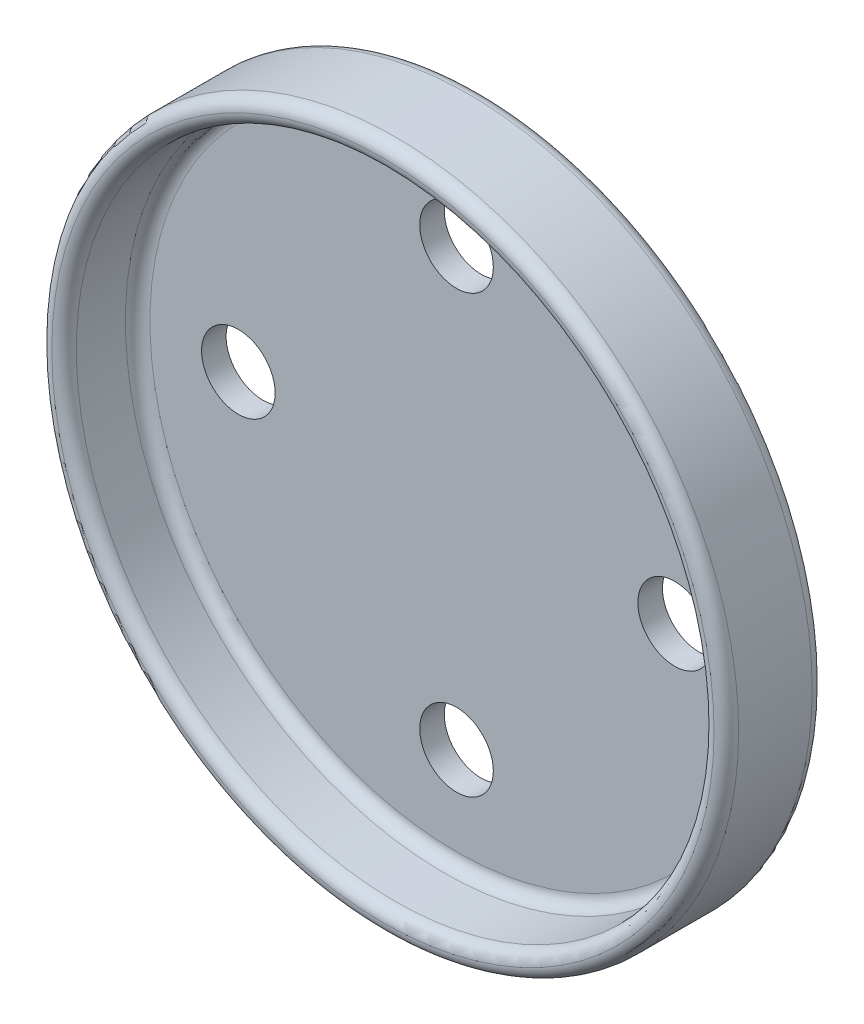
ISO-10303-21;
HEADER;
FILE_DESCRIPTION(('STEP AP214'),'2;1');
FILE_NAME('part.step','',(''),(''),'','','');
FILE_SCHEMA(('AUTOMOTIVE_DESIGN { 1 0 10303 214 1 1 1 1 }'));
ENDSEC;
DATA;
#1=APPLICATION_CONTEXT('core data for automotive mechanical design processes');
#2=APPLICATION_PROTOCOL_DEFINITION('international standard','automotive_design',2000,#1);
#3=PRODUCT_CONTEXT('',#1,'mechanical');
#4=PRODUCT('Part','Part','',(#3));
#5=PRODUCT_RELATED_PRODUCT_CATEGORY('part','',(#4));
#6=PRODUCT_DEFINITION_FORMATION('','',#4);
#7=PRODUCT_DEFINITION_CONTEXT('part definition',#1,'design');
#8=PRODUCT_DEFINITION('design','',#6,#7);
#9=PRODUCT_DEFINITION_SHAPE('','',#8);
#10=(LENGTH_UNIT() NAMED_UNIT(*) SI_UNIT(.MILLI.,.METRE.));
#11=(NAMED_UNIT(*) PLANE_ANGLE_UNIT() SI_UNIT($,.RADIAN.));
#12=(NAMED_UNIT(*) SI_UNIT($,.STERADIAN.) SOLID_ANGLE_UNIT());
#13=UNCERTAINTY_MEASURE_WITH_UNIT(LENGTH_MEASURE(1.E-05),#10,'distance_accuracy_value','');
#14=(GEOMETRIC_REPRESENTATION_CONTEXT(3) GLOBAL_UNCERTAINTY_ASSIGNED_CONTEXT((#13)) GLOBAL_UNIT_ASSIGNED_CONTEXT((#10,
#11,#12)) REPRESENTATION_CONTEXT('',''));
#15=CARTESIAN_POINT('',(0.,0.,0.));
#16=DIRECTION('',(0.,0.,1.));
#17=DIRECTION('',(1.,0.,0.));
#18=AXIS2_PLACEMENT_3D('',#15,#16,#17);
#19=CARTESIAN_POINT('',(0.,0.,20.));
#20=DIRECTION('',(0.,0.,-1.));
#21=DIRECTION('',(-1.,0.,0.));
#22=AXIS2_PLACEMENT_3D('',#19,#20,#21);
#23=CYLINDRICAL_SURFACE('',#22,70.);
#24=CARTESIAN_POINT('',(0.,0.,2.5));
#25=DIRECTION('',(0.,0.,1.));
#26=DIRECTION('',(1.,0.,0.));
#27=AXIS2_PLACEMENT_3D('',#24,#25,#26);
#28=CIRCLE('',#27,70.);
#29=CARTESIAN_POINT('',(70.,0.,2.5));
#30=VERTEX_POINT('',#29);
#31=EDGE_CURVE('E53',#30,#30,#28,.T.);
#32=ORIENTED_EDGE('',*,*,#31,.T.);
#33=EDGE_LOOP('',(#32));
#34=FACE_BOUND('',#33,.T.);
#35=CARTESIAN_POINT('',(0.,0.,17.5));
#36=DIRECTION('',(0.,0.,1.));
#37=DIRECTION('',(1.,0.,0.));
#38=AXIS2_PLACEMENT_3D('',#35,#36,#37);
#39=CIRCLE('',#38,70.);
#40=CARTESIAN_POINT('',(70.,0.,17.5));
#41=VERTEX_POINT('',#40);
#42=EDGE_CURVE('E56',#41,#41,#39,.F.);
#43=ORIENTED_EDGE('',*,*,#42,.T.);
#44=EDGE_LOOP('',(#43));
#45=FACE_BOUND('',#44,.T.);
#46=ADVANCED_FACE('F33',(#34,#45),#23,.T.);
#47=CARTESIAN_POINT('',(0.,0.,0.));
#48=DIRECTION('',(0.,0.,1.));
#49=DIRECTION('',(1.,0.,0.));
#50=AXIS2_PLACEMENT_3D('',#47,#48,#49);
#51=PLANE('',#50);
#52=CARTESIAN_POINT('',(-4.66897023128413E-13,-44.475,0.));
#53=DIRECTION('',(0.,0.,1.));
#54=DIRECTION('',(1.,0.,0.));
#55=AXIS2_PLACEMENT_3D('',#52,#53,#54);
#56=CIRCLE('',#55,7.5);
#57=CARTESIAN_POINT('',(7.49999999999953,-44.475,0.));
#58=VERTEX_POINT('',#57);
#59=EDGE_CURVE('E77',#58,#58,#56,.T.);
#60=ORIENTED_EDGE('',*,*,#59,.T.);
#61=EDGE_LOOP('',(#60));
#62=FACE_BOUND('',#61,.T.);
#63=CARTESIAN_POINT('',(44.475,0.,0.));
#64=DIRECTION('',(0.,0.,1.));
#65=DIRECTION('',(1.,0.,0.));
#66=AXIS2_PLACEMENT_3D('',#63,#64,#65);
#67=CIRCLE('',#66,7.5);
#68=CARTESIAN_POINT('',(51.975,0.,0.));
#69=VERTEX_POINT('',#68);
#70=EDGE_CURVE('E71',#69,#69,#67,.T.);
#71=ORIENTED_EDGE('',*,*,#70,.T.);
#72=EDGE_LOOP('',(#71));
#73=FACE_BOUND('',#72,.T.);
#74=CARTESIAN_POINT('',(1.56329758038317E-13,44.475,0.));
#75=DIRECTION('',(0.,0.,1.));
#76=DIRECTION('',(1.,0.,0.));
#77=AXIS2_PLACEMENT_3D('',#74,#75,#76);
#78=CIRCLE('',#77,7.5);
#79=CARTESIAN_POINT('',(7.50000000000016,44.475,0.));
#80=VERTEX_POINT('',#79);
#81=EDGE_CURVE('E65',#80,#80,#78,.T.);
#82=ORIENTED_EDGE('',*,*,#81,.T.);
#83=EDGE_LOOP('',(#82));
#84=FACE_BOUND('',#83,.T.);
#85=CARTESIAN_POINT('',(-44.475,0.,0.));
#86=DIRECTION('',(0.,0.,1.));
#87=DIRECTION('',(1.,0.,0.));
#88=AXIS2_PLACEMENT_3D('',#85,#86,#87);
#89=CIRCLE('',#88,7.5);
#90=CARTESIAN_POINT('',(-36.975,0.,0.));
#91=VERTEX_POINT('',#90);
#92=EDGE_CURVE('E59',#91,#91,#89,.T.);
#93=ORIENTED_EDGE('',*,*,#92,.T.);
#94=EDGE_LOOP('',(#93));
#95=FACE_BOUND('',#94,.T.);
#96=CARTESIAN_POINT('',(0.,0.,0.));
#97=DIRECTION('',(0.,0.,1.));
#98=DIRECTION('',(1.,0.,0.));
#99=AXIS2_PLACEMENT_3D('',#96,#97,#98);
#100=CIRCLE('',#99,67.5);
#101=CARTESIAN_POINT('',(67.5,0.,0.));
#102=VERTEX_POINT('',#101);
#103=EDGE_CURVE('E50',#102,#102,#100,.F.);
#104=ORIENTED_EDGE('',*,*,#103,.T.);
#105=EDGE_LOOP('',(#104));
#106=FACE_BOUND('',#105,.T.);
#107=ADVANCED_FACE('F114',(#62,#73,#84,#95,#106),#51,.F.);
#108=CARTESIAN_POINT('',(0.,0.,20.));
#109=DIRECTION('',(0.,0.,-1.));
#110=DIRECTION('',(-1.,0.,0.));
#111=AXIS2_PLACEMENT_3D('',#108,#109,#110);
#112=CYLINDRICAL_SURFACE('',#111,65.);
#113=CARTESIAN_POINT('',(0.,0.,7.5));
#114=DIRECTION('',(0.,0.,1.));
#115=DIRECTION('',(1.,0.,0.));
#116=AXIS2_PLACEMENT_3D('',#113,#114,#115);
#117=CIRCLE('',#116,65.);
#118=CARTESIAN_POINT('',(65.,0.,7.5));
#119=VERTEX_POINT('',#118);
#120=EDGE_CURVE('E10',#119,#119,#117,.F.);
#121=ORIENTED_EDGE('',*,*,#120,.T.);
#122=EDGE_LOOP('',(#121));
#123=FACE_BOUND('',#122,.T.);
#124=CARTESIAN_POINT('',(0.,0.,17.5));
#125=DIRECTION('',(0.,0.,1.));
#126=DIRECTION('',(1.,0.,0.));
#127=AXIS2_PLACEMENT_3D('',#124,#125,#126);
#128=CIRCLE('',#127,65.);
#129=CARTESIAN_POINT('',(65.,0.,17.5));
#130=VERTEX_POINT('',#129);
#131=EDGE_CURVE('E41',#130,#130,#128,.T.);
#132=ORIENTED_EDGE('',*,*,#131,.T.);
#133=EDGE_LOOP('',(#132));
#134=FACE_BOUND('',#133,.T.);
#135=ADVANCED_FACE('F91',(#123,#134),#112,.F.);
#136=CARTESIAN_POINT('',(0.,0.,5.));
#137=DIRECTION('',(0.,0.,1.));
#138=DIRECTION('',(1.,0.,0.));
#139=AXIS2_PLACEMENT_3D('',#136,#137,#138);
#140=PLANE('',#139);
#141=CARTESIAN_POINT('',(-4.66897023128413E-13,-44.475,5.));
#142=DIRECTION('',(0.,0.,1.));
#143=DIRECTION('',(0.,1.,0.));
#144=AXIS2_PLACEMENT_3D('',#141,#142,#143);
#145=CIRCLE('',#144,7.5);
#146=CARTESIAN_POINT('',(-3.88338693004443E-13,-36.975,5.));
#147=VERTEX_POINT('',#146);
#148=EDGE_CURVE('E80',#147,#147,#145,.T.);
#149=ORIENTED_EDGE('',*,*,#148,.F.);
#150=EDGE_LOOP('',(#149));
#151=FACE_BOUND('',#150,.T.);
#152=CARTESIAN_POINT('',(44.475,0.,5.));
#153=DIRECTION('',(0.,0.,1.));
#154=DIRECTION('',(-1.,0.,0.));
#155=AXIS2_PLACEMENT_3D('',#152,#153,#154);
#156=CIRCLE('',#155,7.5);
#157=CARTESIAN_POINT('',(36.975,0.,5.));
#158=VERTEX_POINT('',#157);
#159=EDGE_CURVE('E74',#158,#158,#156,.T.);
#160=ORIENTED_EDGE('',*,*,#159,.F.);
#161=EDGE_LOOP('',(#160));
#162=FACE_BOUND('',#161,.T.);
#163=CARTESIAN_POINT('',(1.56329758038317E-13,44.475,5.));
#164=DIRECTION('',(0.,0.,1.));
#165=DIRECTION('',(0.,-1.,0.));
#166=AXIS2_PLACEMENT_3D('',#163,#164,#165);
#167=CIRCLE('',#166,7.5);
#168=CARTESIAN_POINT('',(1.30143647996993E-13,36.975,5.));
#169=VERTEX_POINT('',#168);
#170=EDGE_CURVE('E68',#169,#169,#167,.T.);
#171=ORIENTED_EDGE('',*,*,#170,.F.);
#172=EDGE_LOOP('',(#171));
#173=FACE_BOUND('',#172,.T.);
#174=CARTESIAN_POINT('',(-44.475,0.,5.));
#175=DIRECTION('',(0.,0.,1.));
#176=DIRECTION('',(1.,0.,0.));
#177=AXIS2_PLACEMENT_3D('',#174,#175,#176);
#178=CIRCLE('',#177,7.5);
#179=CARTESIAN_POINT('',(-36.975,0.,5.));
#180=VERTEX_POINT('',#179);
#181=EDGE_CURVE('E62',#180,#180,#178,.T.);
#182=ORIENTED_EDGE('',*,*,#181,.F.);
#183=EDGE_LOOP('',(#182));
#184=FACE_BOUND('',#183,.T.);
#185=CARTESIAN_POINT('',(0.,0.,5.));
#186=DIRECTION('',(0.,0.,1.));
#187=DIRECTION('',(1.,0.,0.));
#188=AXIS2_PLACEMENT_3D('',#185,#186,#187);
#189=CIRCLE('',#188,62.5);
#190=CARTESIAN_POINT('',(62.5,0.,5.));
#191=VERTEX_POINT('',#190);
#192=EDGE_CURVE('E45',#191,#191,#189,.T.);
#193=ORIENTED_EDGE('',*,*,#192,.T.);
#194=EDGE_LOOP('',(#193));
#195=FACE_BOUND('',#194,.T.);
#196=ADVANCED_FACE('F87',(#151,#162,#173,#184,#195),#140,.T.);
#197=CARTESIAN_POINT('',(0.,0.,2.5));
#198=DIRECTION('',(0.,0.,1.));
#199=DIRECTION('',(1.,0.,0.));
#200=AXIS2_PLACEMENT_3D('',#197,#198,#199);
#201=TOROIDAL_SURFACE('',#200,67.5,2.5);
#202=ORIENTED_EDGE('',*,*,#103,.F.);
#203=EDGE_LOOP('',(#202));
#204=FACE_BOUND('',#203,.T.);
#205=ORIENTED_EDGE('',*,*,#31,.F.);
#206=EDGE_LOOP('',(#205));
#207=FACE_BOUND('',#206,.T.);
#208=ADVANCED_FACE('F90',(#204,#207),#201,.T.);
#209=CARTESIAN_POINT('',(0.,0.,7.5));
#210=DIRECTION('',(0.,0.,1.));
#211=DIRECTION('',(1.,0.,0.));
#212=AXIS2_PLACEMENT_3D('',#209,#210,#211);
#213=TOROIDAL_SURFACE('',#212,62.5,2.5);
#214=ORIENTED_EDGE('',*,*,#120,.F.);
#215=EDGE_LOOP('',(#214));
#216=FACE_BOUND('',#215,.T.);
#217=ORIENTED_EDGE('',*,*,#192,.F.);
#218=EDGE_LOOP('',(#217));
#219=FACE_BOUND('',#218,.T.);
#220=ADVANCED_FACE('F101',(#216,#219),#213,.F.);
#221=CARTESIAN_POINT('',(0.,0.,17.5));
#222=DIRECTION('',(0.,0.,1.));
#223=DIRECTION('',(1.,0.,0.));
#224=AXIS2_PLACEMENT_3D('',#221,#222,#223);
#225=TOROIDAL_SURFACE('',#224,67.5,2.5);
#226=ORIENTED_EDGE('',*,*,#42,.F.);
#227=EDGE_LOOP('',(#226));
#228=FACE_BOUND('',#227,.T.);
#229=CARTESIAN_POINT('',(0.,0.,20.));
#230=DIRECTION('',(0.,0.,1.));
#231=DIRECTION('',(1.,0.,0.));
#232=AXIS2_PLACEMENT_3D('',#229,#230,#231);
#233=CIRCLE('',#232,67.5);
#234=CARTESIAN_POINT('',(67.5,0.,20.));
#235=VERTEX_POINT('',#234);
#236=EDGE_CURVE('E37',#235,#235,#233,.T.);
#237=ORIENTED_EDGE('',*,*,#236,.F.);
#238=EDGE_LOOP('',(#237));
#239=FACE_BOUND('',#238,.T.);
#240=ADVANCED_FACE('F35',(#228,#239),#225,.T.);
#241=CARTESIAN_POINT('',(0.,0.,17.5));
#242=DIRECTION('',(0.,0.,1.));
#243=DIRECTION('',(1.,0.,0.));
#244=AXIS2_PLACEMENT_3D('',#241,#242,#243);
#245=TOROIDAL_SURFACE('',#244,67.5,2.5);
#246=ORIENTED_EDGE('',*,*,#236,.T.);
#247=EDGE_LOOP('',(#246));
#248=FACE_BOUND('',#247,.T.);
#249=ORIENTED_EDGE('',*,*,#131,.F.);
#250=EDGE_LOOP('',(#249));
#251=FACE_BOUND('',#250,.T.);
#252=ADVANCED_FACE('F109',(#248,#251),#245,.T.);
#253=CARTESIAN_POINT('',(-44.475,0.,-15.));
#254=DIRECTION('',(0.,0.,1.));
#255=DIRECTION('',(1.,0.,0.));
#256=AXIS2_PLACEMENT_3D('',#253,#254,#255);
#257=CYLINDRICAL_SURFACE('',#256,7.5);
#258=ORIENTED_EDGE('',*,*,#181,.T.);
#259=EDGE_LOOP('',(#258));
#260=FACE_BOUND('',#259,.T.);
#261=ORIENTED_EDGE('',*,*,#92,.F.);
#262=EDGE_LOOP('',(#261));
#263=FACE_BOUND('',#262,.T.);
#264=ADVANCED_FACE('F126',(#260,#263),#257,.F.);
#265=CARTESIAN_POINT('',(1.56329758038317E-13,44.475,-15.));
#266=DIRECTION('',(0.,0.,1.));
#267=DIRECTION('',(1.,0.,0.));
#268=AXIS2_PLACEMENT_3D('',#265,#266,#267);
#269=CYLINDRICAL_SURFACE('',#268,7.5);
#270=ORIENTED_EDGE('',*,*,#170,.T.);
#271=EDGE_LOOP('',(#270));
#272=FACE_BOUND('',#271,.T.);
#273=ORIENTED_EDGE('',*,*,#81,.F.);
#274=EDGE_LOOP('',(#273));
#275=FACE_BOUND('',#274,.T.);
#276=ADVANCED_FACE('F129',(#272,#275),#269,.F.);
#277=CARTESIAN_POINT('',(44.475,0.,-15.));
#278=DIRECTION('',(0.,0.,1.));
#279=DIRECTION('',(1.,0.,0.));
#280=AXIS2_PLACEMENT_3D('',#277,#278,#279);
#281=CYLINDRICAL_SURFACE('',#280,7.5);
#282=ORIENTED_EDGE('',*,*,#159,.T.);
#283=EDGE_LOOP('',(#282));
#284=FACE_BOUND('',#283,.T.);
#285=ORIENTED_EDGE('',*,*,#70,.F.);
#286=EDGE_LOOP('',(#285));
#287=FACE_BOUND('',#286,.T.);
#288=ADVANCED_FACE('F133',(#284,#287),#281,.F.);
#289=CARTESIAN_POINT('',(-4.66897023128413E-13,-44.475,-15.));
#290=DIRECTION('',(0.,0.,1.));
#291=DIRECTION('',(1.,0.,0.));
#292=AXIS2_PLACEMENT_3D('',#289,#290,#291);
#293=CYLINDRICAL_SURFACE('',#292,7.5);
#294=ORIENTED_EDGE('',*,*,#148,.T.);
#295=EDGE_LOOP('',(#294));
#296=FACE_BOUND('',#295,.T.);
#297=ORIENTED_EDGE('',*,*,#59,.F.);
#298=EDGE_LOOP('',(#297));
#299=FACE_BOUND('',#298,.T.);
#300=ADVANCED_FACE('F84',(#296,#299),#293,.F.);
#301=CLOSED_SHELL('',(#46,#107,#135,#196,#208,#220,#240,#252,#264,#276,#288,#300));
#302=MANIFOLD_SOLID_BREP('B2',#301);
#303=ADVANCED_BREP_SHAPE_REPRESENTATION('',(#18,#302),#14);
#304=SHAPE_DEFINITION_REPRESENTATION(#9,#303);
ENDSEC;
END-ISO-10303-21;
